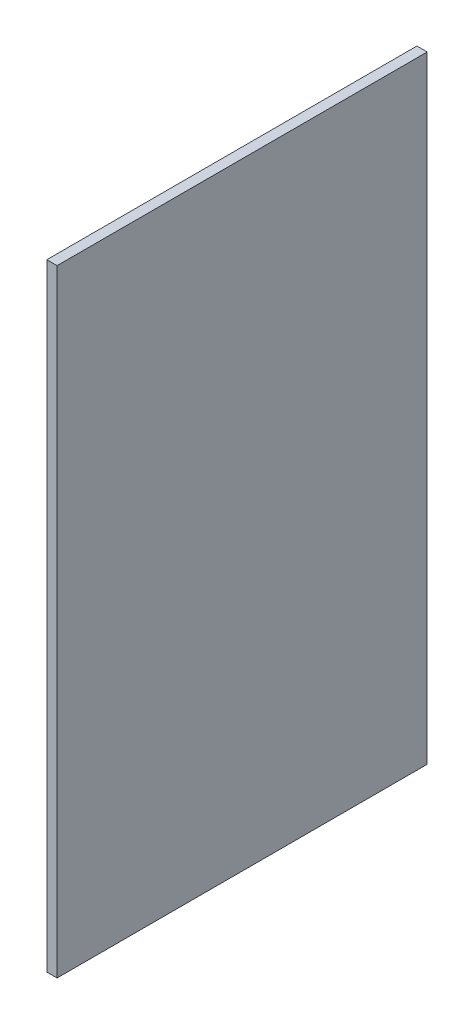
from build123d import *

# Parameters (mm, degrees)
ESQUISSE1_W      = 6
ESQUISSE1_H      = 360
EXTRUSION1_DEPTH = 216


with BuildPart() as part:
    # Esquisse1 → Extrusion1 (new body)
    with BuildSketch(Plane.XY):
        with Locations((-47.537530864, 119.731640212)):
            Rectangle(ESQUISSE1_W, ESQUISSE1_H)
    extrude(amount=EXTRUSION1_DEPTH)


solid = part.part
